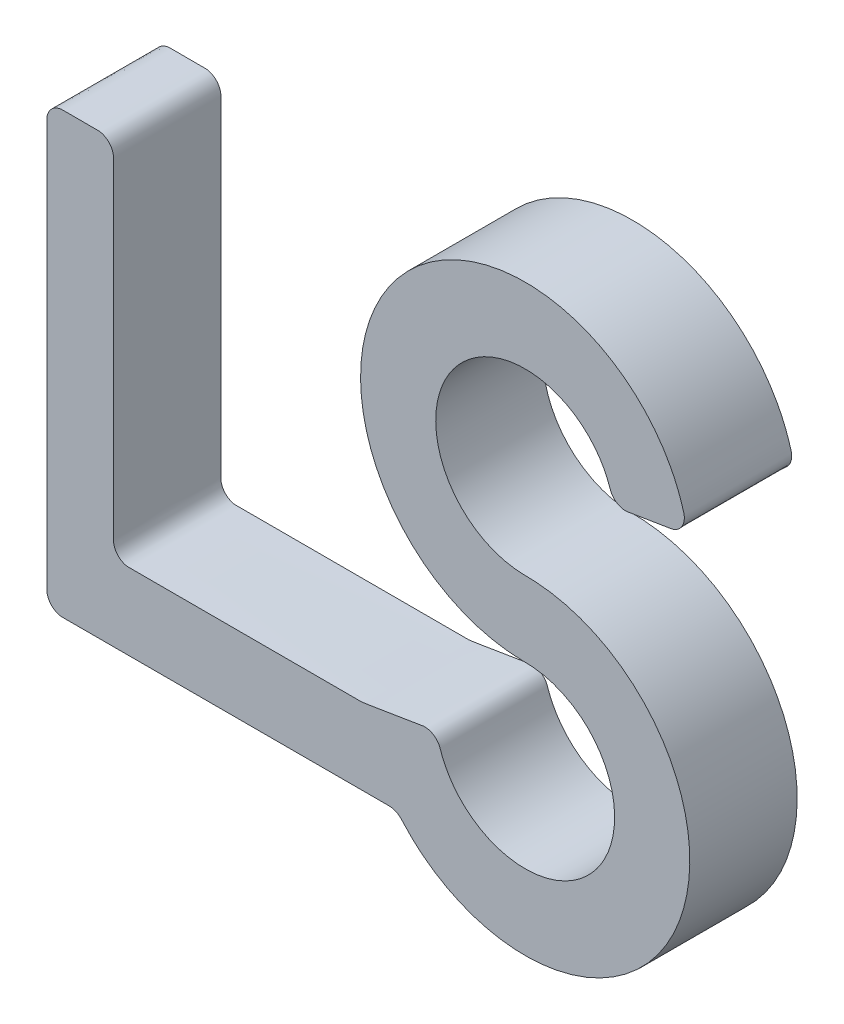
from build123d import *

# Parameters (mm, degrees)
LINEAR_AUSTRAGEN1_DEPTH = 20


with BuildPart() as part:
    # Skizze4 → Linear austragen1 (new body)
    with BuildSketch(Plane.XY):
        with BuildLine():
            add(Edge.make_bspline(
                [(12.408882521, 18.380713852), (12.408882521, 38.149827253), (12.408882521, 57.918940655), (12.408882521, 77.688054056), (12.408882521, 77.818114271), (12.408882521, 78.0782347), (12.408882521, 78.468415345), (12.408882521, 78.728535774), (12.408882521, 78.858595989), (12.408882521, 78.988656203), (12.408882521, 79.248776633), (12.314208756, 79.639693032), (12.230293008, 79.886486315), (12.180521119, 80.006646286), (11.871969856, 80.75155493), (11.301841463, 81.321683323), (10.556932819, 81.630234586), (10.436772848, 81.680006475), (10.189979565, 81.763922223), (9.799063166, 81.858595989), (9.538942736, 81.858595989), (9.408882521, 81.858595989), (9.230858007, 81.858595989), (8.874808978, 81.858595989), (8.340735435, 81.858595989), (7.984686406, 81.858595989), (7.806661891, 81.858595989), (6.738514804, 81.858595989), (5.670367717, 81.858595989), (4.60222063, 81.858595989), (4.424196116, 81.858595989), (4.068147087, 81.858595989), (3.534073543, 81.858595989), (3.178024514, 81.858595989), (3, 81.858595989), (2.869939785, 81.858595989), (2.609819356, 81.858595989), (2.218902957, 81.763922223), (1.972109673, 81.680006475), (1.851949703, 81.630234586), (1.107041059, 81.321683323), (0.536912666, 80.75155493), (0.228361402, 80.006646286), (0.178589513, 79.886486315), (0.094673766, 79.639693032), (0, 79.248776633), (0, 78.988656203), (0, 78.858595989), (0, 78.728535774), (0, 78.468415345), (0, 78.0782347), (0, 77.818114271), (0, 77.688054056), (0, 53.182216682), (0, 28.676379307), (0, 4.170541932), (0, 4.040481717), (0, 3.780361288), (0, 3.390180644), (0, 3.130060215), (0, 3), (0, 2.869939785), (0, 2.609819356), (0.094673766, 2.218902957), (0.178589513, 1.972109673), (0.228361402, 1.851949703), (0.536912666, 1.107041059), (1.107041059, 0.536912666), (1.851949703, 0.228361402), (1.972109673, 0.178589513), (2.218902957, 0.094673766), (2.609819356, 0), (2.869939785, 0), (3, 0), (3.130060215, 0), (3.390180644, 0), (3.780361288, 0), (4.040481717, 0), (4.170541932, 0), (22.394401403, 0), (40.618260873, 0), (58.842120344, 0), (60.076747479, 0), (61.311374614, 0), (62.546001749, 0), (62.683182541, 0), (62.957544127, 0), (63.369086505, 0), (63.643448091, 0), (63.780628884, 0), (63.851433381, 0), (63.993042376, 0), (64.20558481, -0.027715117), (64.345058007, -0.052724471), (64.414265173, -0.067679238), (64.833464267, -0.158262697), (65.224074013, -0.335342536), (65.568470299, -0.590929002), (65.684483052, -0.677025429), (65.904070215, -0.865978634), (66.189140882, -1.196789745), (66.382720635, -1.411306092), (66.48026365, -1.517874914), (82.89844628, -19.455257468), (106.916983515, -15.658379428), (117.001742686, 6.468618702), (127.086501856, 28.595616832), (114.195860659, 49.214486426), (89.887091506, 49.839111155), (89.711319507, 49.843627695), (89.359697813, 49.849637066), (88.83204388, 49.848590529), (88.480518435, 49.859798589), (88.304888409, 49.868182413), (73.398576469, 50.579745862), (66.871800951, 64.000090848), (75.515840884, 76.165000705), (84.159880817, 88.329910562), (98.980388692, 86.581481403), (104.55624208, 72.738999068), (104.646109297, 72.51589683), (104.816183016, 72.065800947), (105.03509082, 71.363381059), (105.288694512, 70.950543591), (105.438158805, 70.762099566), (105.888108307, 70.194804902), (106.50696566, 69.818914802), (107.217809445, 69.681150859), (107.33318148, 69.658791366), (107.566553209, 69.627630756), (107.927486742, 69.608899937), (108.159409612, 69.647036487), (108.275371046, 69.666104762), (108.496486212, 69.702464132), (108.938716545, 69.775182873), (109.602062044, 69.884260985), (110.044292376, 69.956979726), (110.265407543, 69.993339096), (111.904861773, 70.262924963), (113.544316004, 70.53251083), (115.183770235, 70.802096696), (115.30063099, 70.821312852), (115.534352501, 70.859745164), (115.884934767, 70.917393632), (116.118656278, 70.955825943), (116.235517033, 70.975042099), (116.352613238, 70.994296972), (116.586805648, 71.032806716), (116.925906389, 71.168206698), (117.138775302, 71.274103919), (117.241705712, 71.333159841), (118.051516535, 71.797785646), (118.577965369, 72.56883839), (118.715848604, 73.492233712), (118.757693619, 73.772467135), (118.761982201, 74.344790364), (118.513808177, 75.190169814), (118.345933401, 75.731470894), (118.258261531, 76.000906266), (109.487684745, 102.954861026), (81.522132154, 107.57725896), (64.544620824, 84.879179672), (47.567109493, 62.181100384), (59.901343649, 36.660415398), (88.235074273, 35.861413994), (88.426985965, 35.85600215), (88.810911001, 35.848783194), (89.387086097, 35.85006558), (89.770890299, 35.836802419), (89.962620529, 35.826857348), (104.843724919, 35.054972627), (111.31932137, 21.634476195), (102.663096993, 9.505467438), (94.006872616, -2.623541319), (79.210195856, -0.862453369), (73.642628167, 12.959459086), (73.552760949, 13.182561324), (73.382687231, 13.632657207), (73.163779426, 14.335077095), (72.910175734, 14.747914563), (72.760711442, 14.936358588), (72.31076194, 15.503653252), (71.691904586, 15.879543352), (70.981060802, 16.017307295), (70.865688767, 16.039666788), (70.632317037, 16.070827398), (70.271383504, 16.089558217), (70.039460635, 16.051421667), (69.9234992, 16.032353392), (69.807537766, 16.013285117), (69.575614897, 15.975148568), (69.227730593, 15.917943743), (68.995807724, 15.879807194), (68.87984629, 15.860738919), (65.654726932, 15.330412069), (62.429607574, 14.800085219), (59.204488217, 14.26975837), (59.191087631, 14.267554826), (59.16428646, 14.263147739), (59.124084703, 14.256537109), (59.097283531, 14.252130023), (59.083882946, 14.249926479), (59.07048236, 14.247722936), (59.043681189, 14.243315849), (59.003313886, 14.237706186), (58.976377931, 14.234211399), (58.962898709, 14.232555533), (58.8819954, 14.2226169), (58.800754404, 14.215981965), (58.71931057, 14.212661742), (58.705741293, 14.212108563), (58.678595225, 14.211186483), (58.637852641, 14.21017192), (58.610691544, 14.21017192), (58.597110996, 14.21017192), (58.583530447, 14.21017192), (58.55636935, 14.21017192), (58.515627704, 14.21017192), (58.488466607, 14.21017192), (58.474886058, 14.21017192), (44.50973219, 14.21017192), (30.544578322, 14.21017192), (16.579424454, 14.21017192), (16.449364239, 14.21017192), (16.18924381, 14.21017192), (15.799063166, 14.21017192), (15.538942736, 14.21017192), (15.408882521, 14.21017192), (15.278822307, 14.21017192), (15.018701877, 14.21017192), (14.627785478, 14.304845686), (14.380992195, 14.388761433), (14.260832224, 14.438533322), (13.51592358, 14.747084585), (12.945795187, 15.317212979), (12.637243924, 16.062121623), (12.587472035, 16.182281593), (12.503556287, 16.429074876), (12.408882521, 16.819991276), (12.408882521, 17.080111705), (12.408882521, 17.21017192), (12.408882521, 17.340232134), (12.408882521, 17.600352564), (12.408882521, 17.990533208), (12.408882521, 18.250653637), (12.408882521, 18.380713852)],
                knots=[0, 0, 0, 0, 0.093038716, 0.093038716, 0.093038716, 0.093650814, 0.094262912, 0.09487501, 0.09487501, 0.09487501, 0.095487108, 0.096099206, 0.096711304, 0.096711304, 0.096711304, 0.100313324, 0.100313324, 0.100313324, 0.100925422, 0.10153752, 0.102149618, 0.102149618, 0.102149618, 0.102987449, 0.10382528, 0.104663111, 0.104663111, 0.104663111, 0.109690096, 0.109690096, 0.109690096, 0.110527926, 0.111365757, 0.112203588, 0.112203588, 0.112203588, 0.112815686, 0.113427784, 0.114039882, 0.114039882, 0.114039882, 0.117641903, 0.117641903, 0.117641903, 0.118254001, 0.118866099, 0.119478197, 0.119478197, 0.119478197, 0.120090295, 0.120702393, 0.121314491, 0.121314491, 0.121314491, 0.236645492, 0.236645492, 0.236645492, 0.23725759, 0.237869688, 0.238481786, 0.238481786, 0.238481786, 0.239093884, 0.239705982, 0.24031808, 0.24031808, 0.24031808, 0.2439201, 0.2439201, 0.2439201, 0.244532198, 0.245144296, 0.245756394, 0.245756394, 0.245756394, 0.246368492, 0.24698059, 0.247592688, 0.247592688, 0.247592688, 0.333359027, 0.333359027, 0.333359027, 0.339169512, 0.339169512, 0.339169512, 0.339815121, 0.34046073, 0.34110634, 0.34110634, 0.34110634, 0.341439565, 0.341772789, 0.342106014, 0.342106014, 0.342106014, 0.344094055, 0.344094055, 0.344094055, 0.344773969, 0.345453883, 0.346133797, 0.346133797, 0.346133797, 0.426373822, 0.426373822, 0.426373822, 0.506613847, 0.506613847, 0.506613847, 0.50744135, 0.508268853, 0.509096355, 0.509096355, 0.509096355, 0.554969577, 0.554969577, 0.554969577, 0.600842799, 0.600842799, 0.600842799, 0.601974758, 0.603106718, 0.604238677, 0.604238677, 0.604238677, 0.607505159, 0.607505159, 0.607505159, 0.608058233, 0.608611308, 0.609164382, 0.609164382, 0.609164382, 0.610218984, 0.611273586, 0.612328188, 0.612328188, 0.612328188, 0.620147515, 0.620147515, 0.620147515, 0.620704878, 0.621262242, 0.621819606, 0.621819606, 0.621819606, 0.622378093, 0.622936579, 0.623495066, 0.623495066, 0.623495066, 0.627596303, 0.627596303, 0.627596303, 0.628929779, 0.630263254, 0.631596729, 0.631596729, 0.631596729, 0.717003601, 0.717003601, 0.717003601, 0.802410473, 0.802410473, 0.802410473, 0.80331402, 0.804217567, 0.805121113, 0.805121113, 0.805121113, 0.85096845, 0.85096845, 0.85096845, 0.896815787, 0.896815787, 0.896815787, 0.897947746, 0.899079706, 0.900211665, 0.900211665, 0.900211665, 0.903478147, 0.903478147, 0.903478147, 0.904031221, 0.904584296, 0.90513737, 0.90513737, 0.90513737, 0.905690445, 0.906243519, 0.906796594, 0.906796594, 0.906796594, 0.922178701, 0.922178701, 0.922178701, 0.922242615, 0.922306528, 0.922370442, 0.922370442, 0.922370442, 0.922434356, 0.922498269, 0.922562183, 0.922562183, 0.922562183, 0.922945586, 0.922945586, 0.922945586, 0.923009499, 0.923073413, 0.923137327, 0.923137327, 0.923137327, 0.92320124, 0.923265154, 0.923329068, 0.923329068, 0.923329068, 0.989052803, 0.989052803, 0.989052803, 0.989664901, 0.990276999, 0.990889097, 0.990889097, 0.990889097, 0.991501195, 0.992113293, 0.992725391, 0.992725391, 0.992725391, 0.996327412, 0.996327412, 0.996327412, 0.99693951, 0.997551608, 0.998163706, 0.998163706, 0.998163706, 0.998775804, 0.999387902, 1, 1, 1, 1], degree=3, weights=[1, 1, 1, 1, 1, 1, 1, 1, 1, 1, 1, 1, 1, 1, 0.949253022, 0.949253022, 1, 1, 1, 1, 1, 1, 1, 1, 1, 1, 1, 1, 1, 1, 1, 1, 1, 1, 1, 1, 1, 1, 1, 1, 0.949253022, 0.949253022, 1, 1, 1, 1, 1, 1, 1, 1, 1, 1, 1, 1, 1, 1, 1, 1, 1, 1, 1, 1, 1, 1, 1, 1, 0.949253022, 0.949253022, 1, 1, 1, 1, 1, 1, 1, 1, 1, 1, 1, 1, 1, 1, 1, 1, 1, 1, 1, 1, 1, 1, 1, 1, 1, 1, 1, 0.984960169, 0.984960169, 1, 1, 1, 1, 1, 1, 0.701145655, 0.701145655, 1, 0.701145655, 0.701145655, 1, 1, 1, 1, 1, 1, 0.65315803, 0.65315803, 1, 0.65315803, 0.65315803, 1, 1, 1, 1, 1, 1, 0.95856804, 0.95856804, 1, 1, 1, 1, 1, 1, 1, 1, 1, 1, 1, 1, 1, 1, 1, 1, 1, 1, 1, 1, 1, 1, 1, 1, 0.933387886, 0.933387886, 1, 1, 1, 1, 1, 1, 0.640235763, 0.640235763, 1, 0.640235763, 0.640235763, 1, 1, 1, 1, 1, 1, 0.65376096, 0.65376096, 1, 0.65376096, 0.65376096, 1, 1, 1, 1, 1, 1, 0.95856804, 0.95856804, 1, 1, 1, 1, 1, 1, 1, 1, 1, 1, 1, 1, 1, 1, 1, 1, 1, 1, 1, 1, 1, 1, 1, 1, 0.999446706, 0.999446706, 1, 1, 1, 1, 1, 1, 1, 1, 1, 1, 1, 1, 1, 1, 1, 1, 1, 1, 1, 1, 1, 1, 1, 1, 0.949253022, 0.949253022, 1, 1, 1, 1, 1, 1, 1, 1, 1, 1, 1]))
        make_face()
    extrude(amount=-LINEAR_AUSTRAGEN1_DEPTH)


solid = part.part
